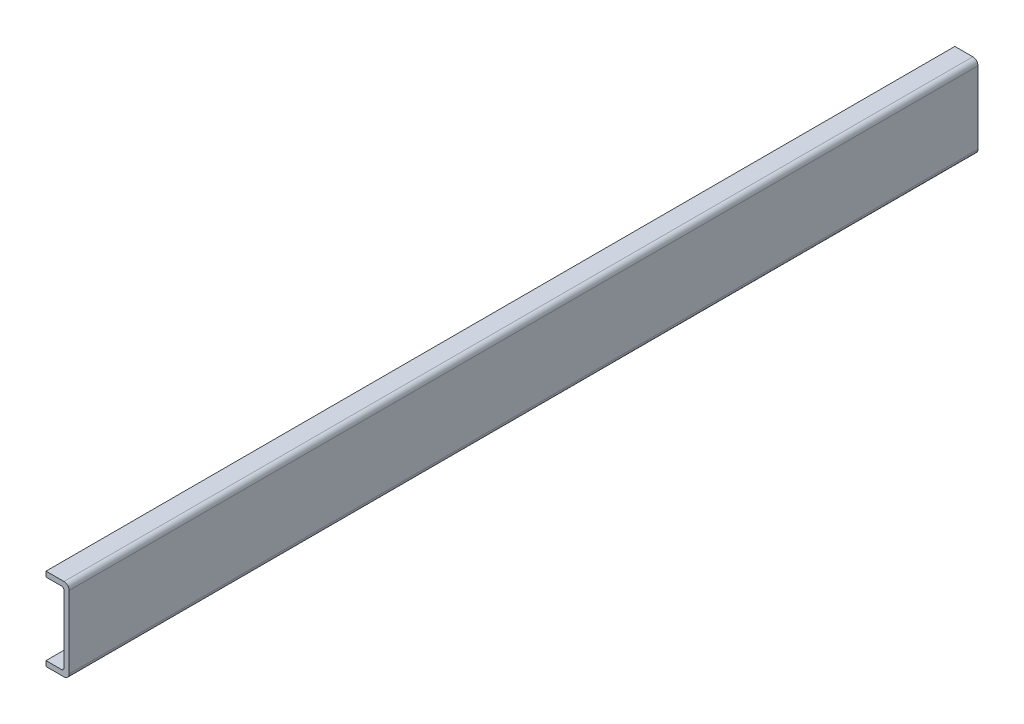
ISO-10303-21;
HEADER;
FILE_DESCRIPTION(('STEP AP214'),'2;1');
FILE_NAME('part.step','',(''),(''),'','','');
FILE_SCHEMA(('AUTOMOTIVE_DESIGN { 1 0 10303 214 1 1 1 1 }'));
ENDSEC;
DATA;
#1=APPLICATION_CONTEXT('core data for automotive mechanical design processes');
#2=APPLICATION_PROTOCOL_DEFINITION('international standard','automotive_design',2000,#1);
#3=PRODUCT_CONTEXT('',#1,'mechanical');
#4=PRODUCT('Part','Part','',(#3));
#5=PRODUCT_RELATED_PRODUCT_CATEGORY('part','',(#4));
#6=PRODUCT_DEFINITION_FORMATION('','',#4);
#7=PRODUCT_DEFINITION_CONTEXT('part definition',#1,'design');
#8=PRODUCT_DEFINITION('design','',#6,#7);
#9=PRODUCT_DEFINITION_SHAPE('','',#8);
#10=(LENGTH_UNIT() NAMED_UNIT(*) SI_UNIT(.MILLI.,.METRE.));
#11=(NAMED_UNIT(*) PLANE_ANGLE_UNIT() SI_UNIT($,.RADIAN.));
#12=(NAMED_UNIT(*) SI_UNIT($,.STERADIAN.) SOLID_ANGLE_UNIT());
#13=UNCERTAINTY_MEASURE_WITH_UNIT(LENGTH_MEASURE(1.E-05),#10,'distance_accuracy_value','');
#14=(GEOMETRIC_REPRESENTATION_CONTEXT(3) GLOBAL_UNCERTAINTY_ASSIGNED_CONTEXT((#13)) GLOBAL_UNIT_ASSIGNED_CONTEXT((#10,
#11,#12)) REPRESENTATION_CONTEXT('',''));
#15=CARTESIAN_POINT('',(0.,0.,0.));
#16=DIRECTION('',(0.,0.,1.));
#17=DIRECTION('',(1.,0.,0.));
#18=AXIS2_PLACEMENT_3D('',#15,#16,#17);
#19=CARTESIAN_POINT('',(0.,6.35,1117.6));
#20=DIRECTION('',(0.,-1.,0.));
#21=DIRECTION('',(1.,0.,0.));
#22=AXIS2_PLACEMENT_3D('',#19,#20,#21);
#23=PLANE('',#22);
#24=DIRECTION('',(-1.,0.,0.));
#25=VECTOR('',#24,1.);
#26=CARTESIAN_POINT('',(0.,6.35,1117.6));
#27=LINE('',#26,#25);
#28=CARTESIAN_POINT('',(-9.398,6.35,1117.6));
#29=VERTEX_POINT('',#28);
#30=CARTESIAN_POINT('',(-28.448,6.35,1117.6));
#31=VERTEX_POINT('',#30);
#32=EDGE_CURVE('E153',#29,#31,#27,.T.);
#33=ORIENTED_EDGE('',*,*,#32,.F.);
#34=DIRECTION('',(0.,0.,-1.));
#35=VECTOR('',#34,1.);
#36=CARTESIAN_POINT('',(-9.398,6.35,0.));
#37=LINE('',#36,#35);
#38=CARTESIAN_POINT('',(-9.398,6.35,0.));
#39=VERTEX_POINT('',#38);
#40=EDGE_CURVE('E117',#29,#39,#37,.T.);
#41=ORIENTED_EDGE('',*,*,#40,.T.);
#42=DIRECTION('',(-1.,0.,0.));
#43=VECTOR('',#42,1.);
#44=CARTESIAN_POINT('',(0.,6.35,0.));
#45=LINE('',#44,#43);
#46=CARTESIAN_POINT('',(-28.448,6.35,0.));
#47=VERTEX_POINT('',#46);
#48=EDGE_CURVE('E113',#39,#47,#45,.T.);
#49=ORIENTED_EDGE('',*,*,#48,.T.);
#50=DIRECTION('',(0.,0.,-1.));
#51=VECTOR('',#50,1.);
#52=CARTESIAN_POINT('',(-28.448,6.35,1117.6));
#53=LINE('',#52,#51);
#54=EDGE_CURVE('E115',#31,#47,#53,.T.);
#55=ORIENTED_EDGE('',*,*,#54,.F.);
#56=EDGE_LOOP('',(#33,#41,#49,#55));
#57=FACE_BOUND('',#56,.T.);
#58=ADVANCED_FACE('F26',(#57),#23,.F.);
#59=CARTESIAN_POINT('',(-28.448,0.,1117.6));
#60=DIRECTION('',(-1.,0.,0.));
#61=DIRECTION('',(0.,0.,1.));
#62=AXIS2_PLACEMENT_3D('',#59,#60,#61);
#63=PLANE('',#62);
#64=DIRECTION('',(0.,1.,0.));
#65=VECTOR('',#64,1.);
#66=CARTESIAN_POINT('',(-28.448,0.,0.));
#67=LINE('',#66,#65);
#68=CARTESIAN_POINT('',(-28.448,0.,0.));
#69=VERTEX_POINT('',#68);
#70=EDGE_CURVE('E120',#69,#47,#67,.T.);
#71=ORIENTED_EDGE('',*,*,#70,.F.);
#72=DIRECTION('',(0.,0.,-1.));
#73=VECTOR('',#72,1.);
#74=CARTESIAN_POINT('',(-28.448,0.,1117.6));
#75=LINE('',#74,#73);
#76=CARTESIAN_POINT('',(-28.448,0.,1117.6));
#77=VERTEX_POINT('',#76);
#78=EDGE_CURVE('E129',#77,#69,#75,.T.);
#79=ORIENTED_EDGE('',*,*,#78,.F.);
#80=DIRECTION('',(0.,1.,0.));
#81=VECTOR('',#80,1.);
#82=CARTESIAN_POINT('',(-28.448,0.,1117.6));
#83=LINE('',#82,#81);
#84=EDGE_CURVE('E127',#77,#31,#83,.T.);
#85=ORIENTED_EDGE('',*,*,#84,.T.);
#86=ORIENTED_EDGE('',*,*,#54,.T.);
#87=EDGE_LOOP('',(#71,#79,#85,#86));
#88=FACE_BOUND('',#87,.T.);
#89=ADVANCED_FACE('F124',(#88),#63,.T.);
#90=CARTESIAN_POINT('',(0.,0.,1117.6));
#91=DIRECTION('',(0.,-1.,0.));
#92=DIRECTION('',(1.,0.,0.));
#93=AXIS2_PLACEMENT_3D('',#90,#91,#92);
#94=PLANE('',#93);
#95=DIRECTION('',(-1.,0.,0.));
#96=VECTOR('',#95,1.);
#97=CARTESIAN_POINT('',(0.,0.,0.));
#98=LINE('',#97,#96);
#99=CARTESIAN_POINT('',(-6.35,0.,0.));
#100=VERTEX_POINT('',#99);
#101=EDGE_CURVE('E134',#100,#69,#98,.T.);
#102=ORIENTED_EDGE('',*,*,#101,.F.);
#103=DIRECTION('',(0.,0.,-1.));
#104=VECTOR('',#103,1.);
#105=CARTESIAN_POINT('',(-6.35,0.,1117.6));
#106=LINE('',#105,#104);
#107=CARTESIAN_POINT('',(-6.35,0.,1117.6));
#108=VERTEX_POINT('',#107);
#109=EDGE_CURVE('E185',#100,#108,#106,.F.);
#110=ORIENTED_EDGE('',*,*,#109,.T.);
#111=DIRECTION('',(-1.,0.,0.));
#112=VECTOR('',#111,1.);
#113=CARTESIAN_POINT('',(0.,0.,1117.6));
#114=LINE('',#113,#112);
#115=EDGE_CURVE('E156',#108,#77,#114,.T.);
#116=ORIENTED_EDGE('',*,*,#115,.T.);
#117=ORIENTED_EDGE('',*,*,#78,.T.);
#118=EDGE_LOOP('',(#102,#110,#116,#117));
#119=FACE_BOUND('',#118,.T.);
#120=ADVANCED_FACE('F226',(#119),#94,.T.);
#121=CARTESIAN_POINT('',(0.,101.6,1117.6));
#122=DIRECTION('',(1.,0.,0.));
#123=DIRECTION('',(0.,1.,0.));
#124=AXIS2_PLACEMENT_3D('',#121,#122,#123);
#125=PLANE('',#124);
#126=DIRECTION('',(0.,-1.,0.));
#127=VECTOR('',#126,1.);
#128=CARTESIAN_POINT('',(0.,101.6,1117.6));
#129=LINE('',#128,#127);
#130=CARTESIAN_POINT('',(0.,95.25,1117.6));
#131=VERTEX_POINT('',#130);
#132=CARTESIAN_POINT('',(0.,6.34999999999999,1117.6));
#133=VERTEX_POINT('',#132);
#134=EDGE_CURVE('E158',#131,#133,#129,.T.);
#135=ORIENTED_EDGE('',*,*,#134,.T.);
#136=DIRECTION('',(0.,0.,-1.));
#137=VECTOR('',#136,1.);
#138=CARTESIAN_POINT('',(0.,6.34999999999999,1117.6));
#139=LINE('',#138,#137);
#140=CARTESIAN_POINT('',(0.,6.34999999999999,0.));
#141=VERTEX_POINT('',#140);
#142=EDGE_CURVE('E178',#133,#141,#139,.T.);
#143=ORIENTED_EDGE('',*,*,#142,.T.);
#144=DIRECTION('',(0.,-1.,0.));
#145=VECTOR('',#144,1.);
#146=CARTESIAN_POINT('',(0.,101.6,0.));
#147=LINE('',#146,#145);
#148=CARTESIAN_POINT('',(0.,95.25,0.));
#149=VERTEX_POINT('',#148);
#150=EDGE_CURVE('E137',#149,#141,#147,.T.);
#151=ORIENTED_EDGE('',*,*,#150,.F.);
#152=DIRECTION('',(0.,0.,-1.));
#153=VECTOR('',#152,1.);
#154=CARTESIAN_POINT('',(0.,95.25,1117.6));
#155=LINE('',#154,#153);
#156=EDGE_CURVE('E128',#149,#131,#155,.F.);
#157=ORIENTED_EDGE('',*,*,#156,.T.);
#158=EDGE_LOOP('',(#135,#143,#151,#157));
#159=FACE_BOUND('',#158,.T.);
#160=ADVANCED_FACE('F231',(#159),#125,.T.);
#161=CARTESIAN_POINT('',(0.,101.6,1117.6));
#162=DIRECTION('',(0.,1.,0.));
#163=DIRECTION('',(0.,0.,1.));
#164=AXIS2_PLACEMENT_3D('',#161,#162,#163);
#165=PLANE('',#164);
#166=DIRECTION('',(1.,0.,0.));
#167=VECTOR('',#166,1.);
#168=CARTESIAN_POINT('',(0.,101.6,1117.6));
#169=LINE('',#168,#167);
#170=CARTESIAN_POINT('',(-28.448,101.6,1117.6));
#171=VERTEX_POINT('',#170);
#172=CARTESIAN_POINT('',(-6.35,101.6,1117.6));
#173=VERTEX_POINT('',#172);
#174=EDGE_CURVE('E161',#171,#173,#169,.T.);
#175=ORIENTED_EDGE('',*,*,#174,.T.);
#176=DIRECTION('',(0.,0.,-1.));
#177=VECTOR('',#176,1.);
#178=CARTESIAN_POINT('',(-6.35,101.6,1117.6));
#179=LINE('',#178,#177);
#180=CARTESIAN_POINT('',(-6.35,101.6,0.));
#181=VERTEX_POINT('',#180);
#182=EDGE_CURVE('E191',#173,#181,#179,.T.);
#183=ORIENTED_EDGE('',*,*,#182,.T.);
#184=DIRECTION('',(1.,0.,0.));
#185=VECTOR('',#184,1.);
#186=CARTESIAN_POINT('',(0.,101.6,0.));
#187=LINE('',#186,#185);
#188=CARTESIAN_POINT('',(-28.448,101.6,0.));
#189=VERTEX_POINT('',#188);
#190=EDGE_CURVE('E141',#189,#181,#187,.T.);
#191=ORIENTED_EDGE('',*,*,#190,.F.);
#192=DIRECTION('',(0.,0.,-1.));
#193=VECTOR('',#192,1.);
#194=CARTESIAN_POINT('',(-28.448,101.6,1117.6));
#195=LINE('',#194,#193);
#196=EDGE_CURVE('E174',#171,#189,#195,.T.);
#197=ORIENTED_EDGE('',*,*,#196,.F.);
#198=EDGE_LOOP('',(#175,#183,#191,#197));
#199=FACE_BOUND('',#198,.T.);
#200=ADVANCED_FACE('F237',(#199),#165,.T.);
#201=CARTESIAN_POINT('',(-28.448,95.25,1117.6));
#202=DIRECTION('',(-1.,0.,0.));
#203=DIRECTION('',(0.,0.,1.));
#204=AXIS2_PLACEMENT_3D('',#201,#202,#203);
#205=PLANE('',#204);
#206=DIRECTION('',(0.,1.,0.));
#207=VECTOR('',#206,1.);
#208=CARTESIAN_POINT('',(-28.448,95.25,0.));
#209=LINE('',#208,#207);
#210=CARTESIAN_POINT('',(-28.448,95.25,0.));
#211=VERTEX_POINT('',#210);
#212=EDGE_CURVE('E144',#211,#189,#209,.T.);
#213=ORIENTED_EDGE('',*,*,#212,.F.);
#214=DIRECTION('',(0.,0.,-1.));
#215=VECTOR('',#214,1.);
#216=CARTESIAN_POINT('',(-28.448,95.25,1117.6));
#217=LINE('',#216,#215);
#218=CARTESIAN_POINT('',(-28.448,95.25,1117.6));
#219=VERTEX_POINT('',#218);
#220=EDGE_CURVE('E172',#219,#211,#217,.T.);
#221=ORIENTED_EDGE('',*,*,#220,.F.);
#222=DIRECTION('',(0.,1.,0.));
#223=VECTOR('',#222,1.);
#224=CARTESIAN_POINT('',(-28.448,95.25,1117.6));
#225=LINE('',#224,#223);
#226=EDGE_CURVE('E164',#219,#171,#225,.T.);
#227=ORIENTED_EDGE('',*,*,#226,.T.);
#228=ORIENTED_EDGE('',*,*,#196,.T.);
#229=EDGE_LOOP('',(#213,#221,#227,#228));
#230=FACE_BOUND('',#229,.T.);
#231=ADVANCED_FACE('F241',(#230),#205,.T.);
#232=CARTESIAN_POINT('',(0.,95.25,1117.6));
#233=DIRECTION('',(0.,1.,0.));
#234=DIRECTION('',(0.,0.,1.));
#235=AXIS2_PLACEMENT_3D('',#232,#233,#234);
#236=PLANE('',#235);
#237=DIRECTION('',(1.,0.,0.));
#238=VECTOR('',#237,1.);
#239=CARTESIAN_POINT('',(0.,95.25,0.));
#240=LINE('',#239,#238);
#241=CARTESIAN_POINT('',(-9.398,95.25,0.));
#242=VERTEX_POINT('',#241);
#243=EDGE_CURVE('E147',#211,#242,#240,.T.);
#244=ORIENTED_EDGE('',*,*,#243,.T.);
#245=DIRECTION('',(0.,0.,-1.));
#246=VECTOR('',#245,1.);
#247=CARTESIAN_POINT('',(-9.398,95.25,1117.6));
#248=LINE('',#247,#246);
#249=CARTESIAN_POINT('',(-9.398,95.25,1117.6));
#250=VERTEX_POINT('',#249);
#251=EDGE_CURVE('E199',#242,#250,#248,.F.);
#252=ORIENTED_EDGE('',*,*,#251,.T.);
#253=DIRECTION('',(1.,0.,0.));
#254=VECTOR('',#253,1.);
#255=CARTESIAN_POINT('',(0.,95.25,1117.6));
#256=LINE('',#255,#254);
#257=EDGE_CURVE('E167',#219,#250,#256,.T.);
#258=ORIENTED_EDGE('',*,*,#257,.F.);
#259=ORIENTED_EDGE('',*,*,#220,.T.);
#260=EDGE_LOOP('',(#244,#252,#258,#259));
#261=FACE_BOUND('',#260,.T.);
#262=ADVANCED_FACE('F244',(#261),#236,.F.);
#263=CARTESIAN_POINT('',(-6.35,101.6,1117.6));
#264=DIRECTION('',(1.,0.,0.));
#265=DIRECTION('',(0.,1.,0.));
#266=AXIS2_PLACEMENT_3D('',#263,#264,#265);
#267=PLANE('',#266);
#268=DIRECTION('',(0.,-1.,0.));
#269=VECTOR('',#268,1.);
#270=CARTESIAN_POINT('',(-6.35,101.6,1117.6));
#271=LINE('',#270,#269);
#272=CARTESIAN_POINT('',(-6.35,92.202,1117.6));
#273=VERTEX_POINT('',#272);
#274=CARTESIAN_POINT('',(-6.35,9.398,1117.6));
#275=VERTEX_POINT('',#274);
#276=EDGE_CURVE('E170',#273,#275,#271,.T.);
#277=ORIENTED_EDGE('',*,*,#276,.F.);
#278=DIRECTION('',(0.,0.,-1.));
#279=VECTOR('',#278,1.);
#280=CARTESIAN_POINT('',(-6.35,92.202,0.));
#281=LINE('',#280,#279);
#282=CARTESIAN_POINT('',(-6.35,92.202,0.));
#283=VERTEX_POINT('',#282);
#284=EDGE_CURVE('E196',#273,#283,#281,.T.);
#285=ORIENTED_EDGE('',*,*,#284,.T.);
#286=DIRECTION('',(0.,-1.,0.));
#287=VECTOR('',#286,1.);
#288=CARTESIAN_POINT('',(-6.35,101.6,0.));
#289=LINE('',#288,#287);
#290=CARTESIAN_POINT('',(-6.35,9.398,0.));
#291=VERTEX_POINT('',#290);
#292=EDGE_CURVE('E150',#283,#291,#289,.T.);
#293=ORIENTED_EDGE('',*,*,#292,.T.);
#294=DIRECTION('',(0.,0.,-1.));
#295=VECTOR('',#294,1.);
#296=CARTESIAN_POINT('',(-6.35,9.398,1117.6));
#297=LINE('',#296,#295);
#298=EDGE_CURVE('E194',#291,#275,#297,.F.);
#299=ORIENTED_EDGE('',*,*,#298,.T.);
#300=EDGE_LOOP('',(#277,#285,#293,#299));
#301=FACE_BOUND('',#300,.T.);
#302=ADVANCED_FACE('F208',(#301),#267,.F.);
#303=CARTESIAN_POINT('',(0.,6.34999999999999,1117.6));
#304=DIRECTION('',(0.,0.,1.));
#305=DIRECTION('',(1.,0.,0.));
#306=AXIS2_PLACEMENT_3D('',#303,#304,#305);
#307=PLANE('',#306);
#308=ORIENTED_EDGE('',*,*,#115,.F.);
#309=CARTESIAN_POINT('',(-6.35,6.34999999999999,1117.6));
#310=DIRECTION('',(0.,0.,1.));
#311=DIRECTION('',(1.,0.,0.));
#312=AXIS2_PLACEMENT_3D('',#309,#310,#311);
#313=CIRCLE('',#312,6.35);
#314=EDGE_CURVE('E189',#108,#133,#313,.T.);
#315=ORIENTED_EDGE('',*,*,#314,.T.);
#316=ORIENTED_EDGE('',*,*,#134,.F.);
#317=CARTESIAN_POINT('',(-6.35,95.25,1117.6));
#318=DIRECTION('',(0.,0.,1.));
#319=DIRECTION('',(1.,0.,0.));
#320=AXIS2_PLACEMENT_3D('',#317,#318,#319);
#321=CIRCLE('',#320,6.35);
#322=EDGE_CURVE('E187',#131,#173,#321,.T.);
#323=ORIENTED_EDGE('',*,*,#322,.T.);
#324=ORIENTED_EDGE('',*,*,#174,.F.);
#325=ORIENTED_EDGE('',*,*,#226,.F.);
#326=ORIENTED_EDGE('',*,*,#257,.T.);
#327=CARTESIAN_POINT('',(-9.398,92.202,1117.6));
#328=DIRECTION('',(0.,0.,1.));
#329=DIRECTION('',(1.,0.,0.));
#330=AXIS2_PLACEMENT_3D('',#327,#328,#329);
#331=CIRCLE('',#330,3.048);
#332=EDGE_CURVE('E204',#250,#273,#331,.F.);
#333=ORIENTED_EDGE('',*,*,#332,.T.);
#334=ORIENTED_EDGE('',*,*,#276,.T.);
#335=CARTESIAN_POINT('',(-9.398,9.398,1117.6));
#336=DIRECTION('',(0.,0.,1.));
#337=DIRECTION('',(1.,0.,0.));
#338=AXIS2_PLACEMENT_3D('',#335,#336,#337);
#339=CIRCLE('',#338,3.048);
#340=EDGE_CURVE('E11',#275,#29,#339,.F.);
#341=ORIENTED_EDGE('',*,*,#340,.T.);
#342=ORIENTED_EDGE('',*,*,#32,.T.);
#343=ORIENTED_EDGE('',*,*,#84,.F.);
#344=EDGE_LOOP('',(#308,#315,#316,#323,#324,#325,#326,#333,#334,#341,#342,#343));
#345=FACE_BOUND('',#344,.T.);
#346=ADVANCED_FACE('F250',(#345),#307,.T.);
#347=CARTESIAN_POINT('',(0.,6.34999999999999,0.));
#348=DIRECTION('',(0.,0.,1.));
#349=DIRECTION('',(1.,0.,0.));
#350=AXIS2_PLACEMENT_3D('',#347,#348,#349);
#351=PLANE('',#350);
#352=ORIENTED_EDGE('',*,*,#150,.T.);
#353=CARTESIAN_POINT('',(-6.35,6.34999999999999,0.));
#354=DIRECTION('',(0.,0.,1.));
#355=DIRECTION('',(1.,0.,0.));
#356=AXIS2_PLACEMENT_3D('',#353,#354,#355);
#357=CIRCLE('',#356,6.35);
#358=EDGE_CURVE('E183',#141,#100,#357,.F.);
#359=ORIENTED_EDGE('',*,*,#358,.T.);
#360=ORIENTED_EDGE('',*,*,#101,.T.);
#361=ORIENTED_EDGE('',*,*,#70,.T.);
#362=ORIENTED_EDGE('',*,*,#48,.F.);
#363=CARTESIAN_POINT('',(-9.398,9.398,0.));
#364=DIRECTION('',(0.,0.,1.));
#365=DIRECTION('',(1.,0.,0.));
#366=AXIS2_PLACEMENT_3D('',#363,#364,#365);
#367=CIRCLE('',#366,3.048);
#368=EDGE_CURVE('E33',#39,#291,#367,.T.);
#369=ORIENTED_EDGE('',*,*,#368,.T.);
#370=ORIENTED_EDGE('',*,*,#292,.F.);
#371=CARTESIAN_POINT('',(-9.398,92.202,0.));
#372=DIRECTION('',(0.,0.,1.));
#373=DIRECTION('',(1.,0.,0.));
#374=AXIS2_PLACEMENT_3D('',#371,#372,#373);
#375=CIRCLE('',#374,3.048);
#376=EDGE_CURVE('E202',#283,#242,#375,.T.);
#377=ORIENTED_EDGE('',*,*,#376,.T.);
#378=ORIENTED_EDGE('',*,*,#243,.F.);
#379=ORIENTED_EDGE('',*,*,#212,.T.);
#380=ORIENTED_EDGE('',*,*,#190,.T.);
#381=CARTESIAN_POINT('',(-6.35,95.25,0.));
#382=DIRECTION('',(0.,0.,1.));
#383=DIRECTION('',(1.,0.,0.));
#384=AXIS2_PLACEMENT_3D('',#381,#382,#383);
#385=CIRCLE('',#384,6.35);
#386=EDGE_CURVE('E181',#181,#149,#385,.F.);
#387=ORIENTED_EDGE('',*,*,#386,.T.);
#388=EDGE_LOOP('',(#352,#359,#360,#361,#362,#369,#370,#377,#378,#379,#380,#387));
#389=FACE_BOUND('',#388,.T.);
#390=ADVANCED_FACE('F132',(#389),#351,.F.);
#391=CARTESIAN_POINT('',(-6.35,6.34999999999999,1117.6));
#392=DIRECTION('',(0.,0.,-1.));
#393=DIRECTION('',(-1.,0.,0.));
#394=AXIS2_PLACEMENT_3D('',#391,#392,#393);
#395=CYLINDRICAL_SURFACE('',#394,6.35);
#396=ORIENTED_EDGE('',*,*,#314,.F.);
#397=ORIENTED_EDGE('',*,*,#109,.F.);
#398=ORIENTED_EDGE('',*,*,#358,.F.);
#399=ORIENTED_EDGE('',*,*,#142,.F.);
#400=EDGE_LOOP('',(#396,#397,#398,#399));
#401=FACE_BOUND('',#400,.T.);
#402=ADVANCED_FACE('F255',(#401),#395,.T.);
#403=CARTESIAN_POINT('',(-6.35,95.25,1117.6));
#404=DIRECTION('',(0.,0.,-1.));
#405=DIRECTION('',(-1.,0.,0.));
#406=AXIS2_PLACEMENT_3D('',#403,#404,#405);
#407=CYLINDRICAL_SURFACE('',#406,6.35);
#408=ORIENTED_EDGE('',*,*,#322,.F.);
#409=ORIENTED_EDGE('',*,*,#156,.F.);
#410=ORIENTED_EDGE('',*,*,#386,.F.);
#411=ORIENTED_EDGE('',*,*,#182,.F.);
#412=EDGE_LOOP('',(#408,#409,#410,#411));
#413=FACE_BOUND('',#412,.T.);
#414=ADVANCED_FACE('F217',(#413),#407,.T.);
#415=CARTESIAN_POINT('',(-9.398,92.202,1117.6));
#416=DIRECTION('',(0.,0.,1.));
#417=DIRECTION('',(1.,0.,0.));
#418=AXIS2_PLACEMENT_3D('',#415,#416,#417);
#419=CYLINDRICAL_SURFACE('',#418,3.048);
#420=ORIENTED_EDGE('',*,*,#332,.F.);
#421=ORIENTED_EDGE('',*,*,#251,.F.);
#422=ORIENTED_EDGE('',*,*,#376,.F.);
#423=ORIENTED_EDGE('',*,*,#284,.F.);
#424=EDGE_LOOP('',(#420,#421,#422,#423));
#425=FACE_BOUND('',#424,.T.);
#426=ADVANCED_FACE('F212',(#425),#419,.F.);
#427=CARTESIAN_POINT('',(-9.398,9.398,1117.6));
#428=DIRECTION('',(0.,0.,1.));
#429=DIRECTION('',(1.,0.,0.));
#430=AXIS2_PLACEMENT_3D('',#427,#428,#429);
#431=CYLINDRICAL_SURFACE('',#430,3.048);
#432=ORIENTED_EDGE('',*,*,#340,.F.);
#433=ORIENTED_EDGE('',*,*,#298,.F.);
#434=ORIENTED_EDGE('',*,*,#368,.F.);
#435=ORIENTED_EDGE('',*,*,#40,.F.);
#436=EDGE_LOOP('',(#432,#433,#434,#435));
#437=FACE_BOUND('',#436,.T.);
#438=ADVANCED_FACE('F210',(#437),#431,.F.);
#439=CLOSED_SHELL('',(#58,#89,#120,#160,#200,#231,#262,#302,#346,#390,#402,#414,#426,#438));
#440=MANIFOLD_SOLID_BREP('B2',#439);
#441=ADVANCED_BREP_SHAPE_REPRESENTATION('',(#18,#440),#14);
#442=SHAPE_DEFINITION_REPRESENTATION(#9,#441);
ENDSEC;
END-ISO-10303-21;
